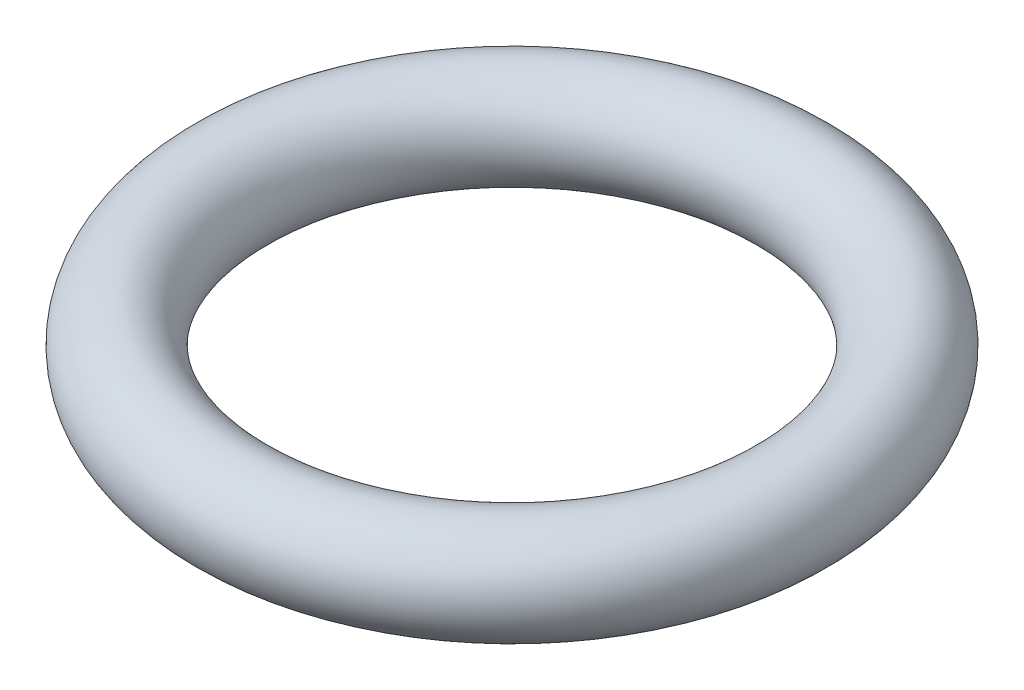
ISO-10303-21;
HEADER;
FILE_DESCRIPTION(('STEP AP214'),'2;1');
FILE_NAME('part.step','',(''),(''),'','','');
FILE_SCHEMA(('AUTOMOTIVE_DESIGN { 1 0 10303 214 1 1 1 1 }'));
ENDSEC;
DATA;
#1=APPLICATION_CONTEXT('core data for automotive mechanical design processes');
#2=APPLICATION_PROTOCOL_DEFINITION('international standard','automotive_design',2000,#1);
#3=PRODUCT_CONTEXT('',#1,'mechanical');
#4=PRODUCT('Part','Part','',(#3));
#5=PRODUCT_RELATED_PRODUCT_CATEGORY('part','',(#4));
#6=PRODUCT_DEFINITION_FORMATION('','',#4);
#7=PRODUCT_DEFINITION_CONTEXT('part definition',#1,'design');
#8=PRODUCT_DEFINITION('design','',#6,#7);
#9=PRODUCT_DEFINITION_SHAPE('','',#8);
#10=(LENGTH_UNIT() NAMED_UNIT(*) SI_UNIT(.MILLI.,.METRE.));
#11=(NAMED_UNIT(*) PLANE_ANGLE_UNIT() SI_UNIT($,.RADIAN.));
#12=(NAMED_UNIT(*) SI_UNIT($,.STERADIAN.) SOLID_ANGLE_UNIT());
#13=UNCERTAINTY_MEASURE_WITH_UNIT(LENGTH_MEASURE(1.E-05),#10,'distance_accuracy_value','');
#14=(GEOMETRIC_REPRESENTATION_CONTEXT(3) GLOBAL_UNCERTAINTY_ASSIGNED_CONTEXT((#13)) GLOBAL_UNIT_ASSIGNED_CONTEXT((#10,
#11,#12)) REPRESENTATION_CONTEXT('',''));
#15=CARTESIAN_POINT('',(0.,0.,0.));
#16=DIRECTION('',(0.,0.,1.));
#17=DIRECTION('',(1.,0.,0.));
#18=AXIS2_PLACEMENT_3D('',#15,#16,#17);
#19=CARTESIAN_POINT('',(0.,0.,0.));
#20=DIRECTION('',(0.,-1.,0.));
#21=DIRECTION('',(0.,0.,-1.));
#22=AXIS2_PLACEMENT_3D('',#19,#20,#21);
#23=TOROIDAL_SURFACE('',#22,8.4,1.5);
#24=CARTESIAN_POINT('',(0.,0.,-9.9));
#25=VERTEX_POINT('',#24);
#26=VERTEX_LOOP('',#25);
#27=FACE_BOUND('',#26,.T.);
#28=ADVANCED_FACE('F26',(#27),#23,.T.);
#29=CLOSED_SHELL('',(#28));
#30=MANIFOLD_SOLID_BREP('B2',#29);
#31=ADVANCED_BREP_SHAPE_REPRESENTATION('',(#18,#30),#14);
#32=SHAPE_DEFINITION_REPRESENTATION(#9,#31);
ENDSEC;
END-ISO-10303-21;
